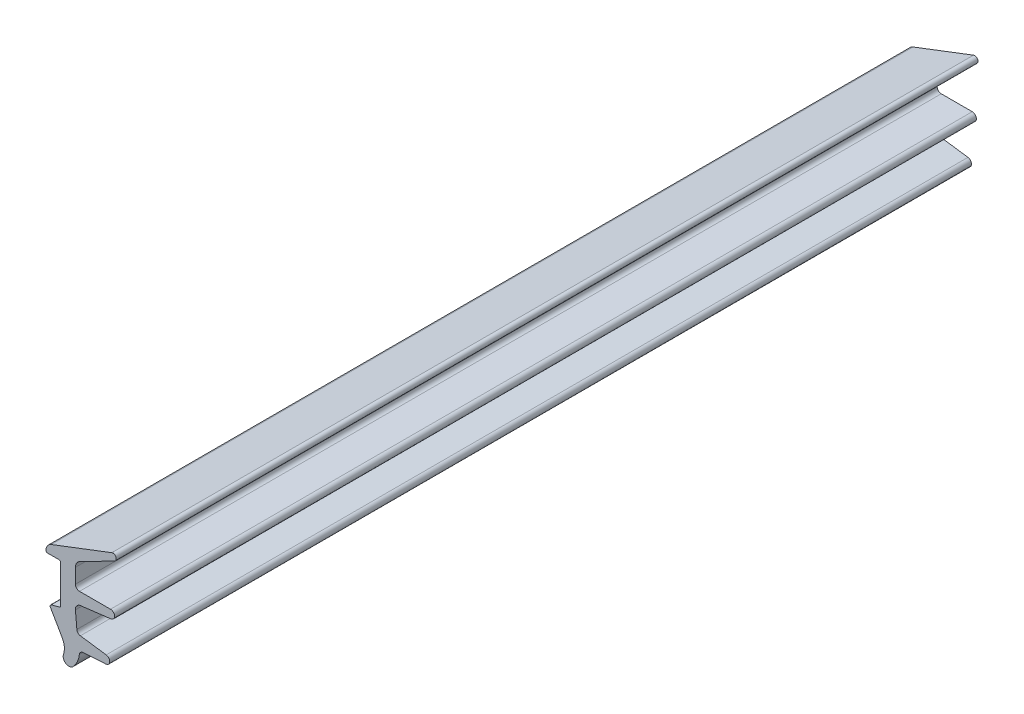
ISO-10303-21;
HEADER;
FILE_DESCRIPTION(('STEP AP214'),'2;1');
FILE_NAME('part.step','',(''),(''),'','','');
FILE_SCHEMA(('AUTOMOTIVE_DESIGN { 1 0 10303 214 1 1 1 1 }'));
ENDSEC;
DATA;
#1=APPLICATION_CONTEXT('core data for automotive mechanical design processes');
#2=APPLICATION_PROTOCOL_DEFINITION('international standard','automotive_design',2000,#1);
#3=PRODUCT_CONTEXT('',#1,'mechanical');
#4=PRODUCT('Part','Part','',(#3));
#5=PRODUCT_RELATED_PRODUCT_CATEGORY('part','',(#4));
#6=PRODUCT_DEFINITION_FORMATION('','',#4);
#7=PRODUCT_DEFINITION_CONTEXT('part definition',#1,'design');
#8=PRODUCT_DEFINITION('design','',#6,#7);
#9=PRODUCT_DEFINITION_SHAPE('','',#8);
#10=(LENGTH_UNIT() NAMED_UNIT(*) SI_UNIT(.MILLI.,.METRE.));
#11=(NAMED_UNIT(*) PLANE_ANGLE_UNIT() SI_UNIT($,.RADIAN.));
#12=(NAMED_UNIT(*) SI_UNIT($,.STERADIAN.) SOLID_ANGLE_UNIT());
#13=UNCERTAINTY_MEASURE_WITH_UNIT(LENGTH_MEASURE(1.E-05),#10,'distance_accuracy_value','');
#14=(GEOMETRIC_REPRESENTATION_CONTEXT(3) GLOBAL_UNCERTAINTY_ASSIGNED_CONTEXT((#13)) GLOBAL_UNIT_ASSIGNED_CONTEXT((#10,
#11,#12)) REPRESENTATION_CONTEXT('',''));
#15=CARTESIAN_POINT('',(0.,0.,0.));
#16=DIRECTION('',(0.,0.,1.));
#17=DIRECTION('',(1.,0.,0.));
#18=AXIS2_PLACEMENT_3D('',#15,#16,#17);
#19=CARTESIAN_POINT('',(-1.15176380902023,-5.26207958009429,0.));
#20=DIRECTION('',(-0.258819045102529,0.965925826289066,0.));
#21=DIRECTION('',(-0.965925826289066,-0.258819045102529,0.));
#22=AXIS2_PLACEMENT_3D('',#19,#20,#21);
#23=PLANE('',#22);
#24=DIRECTION('',(-0.965925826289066,-0.258819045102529,0.));
#25=VECTOR('',#24,1.);
#26=CARTESIAN_POINT('',(-1.15176380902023,-5.26207958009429,-52.75));
#27=LINE('',#26,#25);
#28=CARTESIAN_POINT('',(-0.148236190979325,-4.99318516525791,-52.75));
#29=VERTEX_POINT('',#28);
#30=CARTESIAN_POINT('',(-1.15176380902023,-5.2620795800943,-52.75));
#31=VERTEX_POINT('',#30);
#32=EDGE_CURVE('E214',#29,#31,#27,.T.);
#33=ORIENTED_EDGE('',*,*,#32,.T.);
#34=DIRECTION('',(0.,0.,1.));
#35=VECTOR('',#34,1.);
#36=CARTESIAN_POINT('',(-1.15176380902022,-5.26207958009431,0.));
#37=LINE('',#36,#35);
#38=CARTESIAN_POINT('',(-1.15176380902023,-5.2620795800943,52.75));
#39=VERTEX_POINT('',#38);
#40=EDGE_CURVE('E351',#39,#31,#37,.F.);
#41=ORIENTED_EDGE('',*,*,#40,.F.);
#42=DIRECTION('',(-0.965925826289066,-0.258819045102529,0.));
#43=VECTOR('',#42,1.);
#44=CARTESIAN_POINT('',(-1.15176380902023,-5.26207958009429,52.75));
#45=LINE('',#44,#43);
#46=CARTESIAN_POINT('',(-0.148236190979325,-4.99318516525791,52.75));
#47=VERTEX_POINT('',#46);
#48=EDGE_CURVE('E357',#39,#47,#45,.F.);
#49=ORIENTED_EDGE('',*,*,#48,.T.);
#50=DIRECTION('',(0.,0.,1.));
#51=VECTOR('',#50,1.);
#52=CARTESIAN_POINT('',(-0.148236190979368,-4.99318516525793,0.));
#53=LINE('',#52,#51);
#54=EDGE_CURVE('E359',#47,#29,#53,.F.);
#55=ORIENTED_EDGE('',*,*,#54,.T.);
#56=EDGE_LOOP('',(#33,#41,#49,#55));
#57=FACE_BOUND('',#56,.T.);
#58=ADVANCED_FACE('F15',(#57),#23,.T.);
#59=CARTESIAN_POINT('',(-0.19999999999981,-0.200000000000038,0.));
#60=DIRECTION('',(0.,0.,1.));
#61=DIRECTION('',(1.,0.,0.));
#62=AXIS2_PLACEMENT_3D('',#59,#60,#61);
#63=CYLINDRICAL_SURFACE('',#62,0.199999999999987);
#64=DIRECTION('',(0.,0.,-1.));
#65=VECTOR('',#64,1.);
#66=CARTESIAN_POINT('',(-0.19999999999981,0.,0.));
#67=LINE('',#66,#65);
#68=CARTESIAN_POINT('',(-0.19999999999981,0.,-52.75));
#69=VERTEX_POINT('',#68);
#70=CARTESIAN_POINT('',(-0.19999999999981,0.,52.75));
#71=VERTEX_POINT('',#70);
#72=EDGE_CURVE('E210',#69,#71,#67,.F.);
#73=ORIENTED_EDGE('',*,*,#72,.F.);
#74=CARTESIAN_POINT('',(-0.19999999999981,-0.200000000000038,-52.75));
#75=DIRECTION('',(0.,0.,1.));
#76=DIRECTION('',(1.,0.,0.));
#77=AXIS2_PLACEMENT_3D('',#74,#75,#76);
#78=CIRCLE('',#77,0.199999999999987);
#79=CARTESIAN_POINT('',(1.95047970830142E-13,-0.200000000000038,-52.75));
#80=VERTEX_POINT('',#79);
#81=EDGE_CURVE('E18',#80,#69,#78,.T.);
#82=ORIENTED_EDGE('',*,*,#81,.F.);
#83=DIRECTION('',(0.,0.,1.));
#84=VECTOR('',#83,1.);
#85=CARTESIAN_POINT('',(2.036238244E-13,-0.200000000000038,0.));
#86=LINE('',#85,#84);
#87=CARTESIAN_POINT('',(1.95047970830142E-13,-0.200000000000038,52.75));
#88=VERTEX_POINT('',#87);
#89=EDGE_CURVE('E207',#88,#80,#86,.F.);
#90=ORIENTED_EDGE('',*,*,#89,.F.);
#91=CARTESIAN_POINT('',(-0.19999999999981,-0.200000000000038,52.75));
#92=DIRECTION('',(0.,0.,1.));
#93=DIRECTION('',(1.,0.,0.));
#94=AXIS2_PLACEMENT_3D('',#91,#92,#93);
#95=CIRCLE('',#94,0.199999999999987);
#96=EDGE_CURVE('E213',#71,#88,#95,.F.);
#97=ORIENTED_EDGE('',*,*,#96,.F.);
#98=EDGE_LOOP('',(#73,#82,#90,#97));
#99=FACE_BOUND('',#98,.T.);
#100=ADVANCED_FACE('F205',(#99),#63,.F.);
#101=CARTESIAN_POINT('',(-0.199999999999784,-4.80000000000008,0.));
#102=DIRECTION('',(0.,0.,1.));
#103=DIRECTION('',(1.,0.,0.));
#104=AXIS2_PLACEMENT_3D('',#101,#102,#103);
#105=CYLINDRICAL_SURFACE('',#104,0.200000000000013);
#106=DIRECTION('',(0.,0.,1.));
#107=VECTOR('',#106,1.);
#108=CARTESIAN_POINT('',(2.036238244E-13,-4.80000000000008,0.));
#109=LINE('',#108,#107);
#110=CARTESIAN_POINT('',(1.95047970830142E-13,-4.80000000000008,-52.75));
#111=VERTEX_POINT('',#110);
#112=CARTESIAN_POINT('',(1.95047970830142E-13,-4.80000000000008,52.75));
#113=VERTEX_POINT('',#112);
#114=EDGE_CURVE('E222',#111,#113,#109,.T.);
#115=ORIENTED_EDGE('',*,*,#114,.F.);
#116=CARTESIAN_POINT('',(-0.199999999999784,-4.80000000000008,-52.75));
#117=DIRECTION('',(0.,0.,1.));
#118=DIRECTION('',(1.,0.,0.));
#119=AXIS2_PLACEMENT_3D('',#116,#117,#118);
#120=CIRCLE('',#119,0.200000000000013);
#121=EDGE_CURVE('E226',#29,#111,#120,.T.);
#122=ORIENTED_EDGE('',*,*,#121,.F.);
#123=ORIENTED_EDGE('',*,*,#54,.F.);
#124=CARTESIAN_POINT('',(-0.199999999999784,-4.80000000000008,52.75));
#125=DIRECTION('',(0.,0.,1.));
#126=DIRECTION('',(1.,0.,0.));
#127=AXIS2_PLACEMENT_3D('',#124,#125,#126);
#128=CIRCLE('',#127,0.200000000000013);
#129=EDGE_CURVE('E417',#113,#47,#128,.F.);
#130=ORIENTED_EDGE('',*,*,#129,.F.);
#131=EDGE_LOOP('',(#115,#122,#123,#130));
#132=FACE_BOUND('',#131,.T.);
#133=ADVANCED_FACE('F502',(#132),#105,.F.);
#134=CARTESIAN_POINT('',(-1.09999999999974,-5.45526474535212,0.));
#135=DIRECTION('',(0.,0.,1.));
#136=DIRECTION('',(1.,0.,0.));
#137=AXIS2_PLACEMENT_3D('',#134,#135,#136);
#138=CYLINDRICAL_SURFACE('',#137,0.199999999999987);
#139=CARTESIAN_POINT('',(-1.09999999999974,-5.45526474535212,-52.75));
#140=DIRECTION('',(0.,0.,1.));
#141=DIRECTION('',(1.,0.,0.));
#142=AXIS2_PLACEMENT_3D('',#139,#140,#141);
#143=CIRCLE('',#142,0.199999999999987);
#144=CARTESIAN_POINT('',(-1.27320508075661,-5.55526474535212,-52.75));
#145=VERTEX_POINT('',#144);
#146=EDGE_CURVE('E354',#31,#145,#143,.T.);
#147=ORIENTED_EDGE('',*,*,#146,.T.);
#148=DIRECTION('',(0.,0.,1.));
#149=VECTOR('',#148,1.);
#150=CARTESIAN_POINT('',(-1.27320508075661,-5.55526474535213,0.));
#151=LINE('',#150,#149);
#152=CARTESIAN_POINT('',(-1.27320508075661,-5.55526474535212,52.75));
#153=VERTEX_POINT('',#152);
#154=EDGE_CURVE('E329',#153,#145,#151,.F.);
#155=ORIENTED_EDGE('',*,*,#154,.F.);
#156=CARTESIAN_POINT('',(-1.09999999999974,-5.45526474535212,52.75));
#157=DIRECTION('',(0.,0.,1.));
#158=DIRECTION('',(1.,0.,0.));
#159=AXIS2_PLACEMENT_3D('',#156,#157,#158);
#160=CIRCLE('',#159,0.199999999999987);
#161=EDGE_CURVE('E355',#153,#39,#160,.F.);
#162=ORIENTED_EDGE('',*,*,#161,.T.);
#163=ORIENTED_EDGE('',*,*,#40,.T.);
#164=EDGE_LOOP('',(#147,#155,#162,#163));
#165=FACE_BOUND('',#164,.T.);
#166=ADVANCED_FACE('F497',(#165),#138,.T.);
#167=CARTESIAN_POINT('',(-1.54837324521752,-9.07865950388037,0.));
#168=DIRECTION('',(0.,0.,1.));
#169=DIRECTION('',(1.,0.,0.));
#170=AXIS2_PLACEMENT_3D('',#167,#168,#169);
#171=CYLINDRICAL_SURFACE('',#170,2.);
#172=DIRECTION('',(0.,0.,1.));
#173=VECTOR('',#172,1.);
#174=CARTESIAN_POINT('',(0.183677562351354,-8.07865950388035,0.));
#175=LINE('',#174,#173);
#176=CARTESIAN_POINT('',(0.183677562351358,-8.07865950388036,-52.75));
#177=VERTEX_POINT('',#176);
#178=CARTESIAN_POINT('',(0.183677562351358,-8.07865950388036,52.75));
#179=VERTEX_POINT('',#178);
#180=EDGE_CURVE('E328',#177,#179,#175,.T.);
#181=ORIENTED_EDGE('',*,*,#180,.F.);
#182=CARTESIAN_POINT('',(-1.54837324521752,-9.07865950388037,-52.75));
#183=DIRECTION('',(0.,0.,1.));
#184=DIRECTION('',(1.,0.,0.));
#185=AXIS2_PLACEMENT_3D('',#182,#183,#184);
#186=CIRCLE('',#185,2.);
#187=CARTESIAN_POINT('',(0.383478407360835,-9.59629759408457,-52.75));
#188=VERTEX_POINT('',#187);
#189=EDGE_CURVE('E412',#188,#177,#186,.T.);
#190=ORIENTED_EDGE('',*,*,#189,.F.);
#191=DIRECTION('',(0.,0.,1.));
#192=VECTOR('',#191,1.);
#193=CARTESIAN_POINT('',(0.383478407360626,-9.59629759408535,0.));
#194=LINE('',#193,#192);
#195=CARTESIAN_POINT('',(0.383478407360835,-9.59629759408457,52.75));
#196=VERTEX_POINT('',#195);
#197=EDGE_CURVE('E343',#196,#188,#194,.F.);
#198=ORIENTED_EDGE('',*,*,#197,.F.);
#199=CARTESIAN_POINT('',(-1.54837324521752,-9.07865950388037,52.75));
#200=DIRECTION('',(0.,0.,1.));
#201=DIRECTION('',(1.,0.,0.));
#202=AXIS2_PLACEMENT_3D('',#199,#200,#201);
#203=CIRCLE('',#202,2.);
#204=EDGE_CURVE('E344',#179,#196,#203,.F.);
#205=ORIENTED_EDGE('',*,*,#204,.F.);
#206=EDGE_LOOP('',(#181,#190,#198,#205));
#207=FACE_BOUND('',#206,.T.);
#208=ADVANCED_FACE('F489',(#207),#171,.F.);
#209=CARTESIAN_POINT('',(0.323851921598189,-9.81882666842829,0.));
#210=DIRECTION('',(-0.965925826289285,0.258819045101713,0.));
#211=DIRECTION('',(-0.258819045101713,-0.965925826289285,0.));
#212=AXIS2_PLACEMENT_3D('',#209,#210,#211);
#213=PLANE('',#212);
#214=DIRECTION('',(-0.258819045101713,-0.965925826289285,0.));
#215=VECTOR('',#214,1.);
#216=CARTESIAN_POINT('',(0.323851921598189,-9.81882666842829,-52.75));
#217=LINE('',#216,#215);
#218=CARTESIAN_POINT('',(0.323851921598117,-9.81882666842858,-52.75));
#219=VERTEX_POINT('',#218);
#220=EDGE_CURVE('E345',#188,#219,#217,.T.);
#221=ORIENTED_EDGE('',*,*,#220,.T.);
#222=DIRECTION('',(0.,0.,1.));
#223=VECTOR('',#222,1.);
#224=CARTESIAN_POINT('',(0.323851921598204,-9.8188266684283,0.));
#225=LINE('',#224,#223);
#226=CARTESIAN_POINT('',(0.323851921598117,-9.81882666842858,52.75));
#227=VERTEX_POINT('',#226);
#228=EDGE_CURVE('E323',#227,#219,#225,.F.);
#229=ORIENTED_EDGE('',*,*,#228,.F.);
#230=DIRECTION('',(-0.258819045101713,-0.965925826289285,0.));
#231=VECTOR('',#230,1.);
#232=CARTESIAN_POINT('',(0.323851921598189,-9.81882666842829,52.75));
#233=LINE('',#232,#231);
#234=EDGE_CURVE('E340',#227,#196,#233,.F.);
#235=ORIENTED_EDGE('',*,*,#234,.T.);
#236=ORIENTED_EDGE('',*,*,#197,.T.);
#237=EDGE_LOOP('',(#221,#229,#235,#236));
#238=FACE_BOUND('',#237,.T.);
#239=ADVANCED_FACE('F485',(#238),#213,.T.);
#240=CARTESIAN_POINT('',(2.77918139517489,-8.86828108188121,0.));
#241=DIRECTION('',(0.,0.,1.));
#242=DIRECTION('',(1.,0.,0.));
#243=AXIS2_PLACEMENT_3D('',#240,#241,#242);
#244=CYLINDRICAL_SURFACE('',#243,0.500000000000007);
#245=DIRECTION('',(0.,0.,1.));
#246=VECTOR('',#245,1.);
#247=CARTESIAN_POINT('',(2.28240305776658,-8.81161289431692,0.));
#248=LINE('',#247,#246);
#249=CARTESIAN_POINT('',(2.28240305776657,-8.81161289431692,-52.75));
#250=VERTEX_POINT('',#249);
#251=CARTESIAN_POINT('',(2.28240305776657,-8.81161289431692,52.75));
#252=VERTEX_POINT('',#251);
#253=EDGE_CURVE('E317',#250,#252,#248,.T.);
#254=ORIENTED_EDGE('',*,*,#253,.F.);
#255=CARTESIAN_POINT('',(2.77918139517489,-8.86828108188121,-52.75));
#256=DIRECTION('',(0.,0.,1.));
#257=DIRECTION('',(1.,0.,0.));
#258=AXIS2_PLACEMENT_3D('',#255,#256,#257);
#259=CIRCLE('',#258,0.500000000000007);
#260=CARTESIAN_POINT('',(2.74865712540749,-8.36921368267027,-52.75));
#261=VERTEX_POINT('',#260);
#262=EDGE_CURVE('E347',#261,#250,#259,.T.);
#263=ORIENTED_EDGE('',*,*,#262,.F.);
#264=DIRECTION('',(0.,0.,1.));
#265=VECTOR('',#264,1.);
#266=CARTESIAN_POINT('',(2.7486571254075,-8.36921368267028,0.));
#267=LINE('',#266,#265);
#268=CARTESIAN_POINT('',(2.74865712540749,-8.36921368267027,52.75));
#269=VERTEX_POINT('',#268);
#270=EDGE_CURVE('E314',#269,#261,#267,.F.);
#271=ORIENTED_EDGE('',*,*,#270,.F.);
#272=CARTESIAN_POINT('',(2.77918139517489,-8.86828108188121,52.75));
#273=DIRECTION('',(0.,0.,1.));
#274=DIRECTION('',(1.,0.,0.));
#275=AXIS2_PLACEMENT_3D('',#272,#273,#274);
#276=CIRCLE('',#275,0.500000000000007);
#277=EDGE_CURVE('E408',#252,#269,#276,.F.);
#278=ORIENTED_EDGE('',*,*,#277,.F.);
#279=EDGE_LOOP('',(#254,#263,#271,#278));
#280=FACE_BOUND('',#279,.T.);
#281=ADVANCED_FACE('F475',(#280),#244,.F.);
#282=CARTESIAN_POINT('',(5.5000000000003,-7.69999999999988,0.));
#283=DIRECTION('',(0.,0.,1.));
#284=DIRECTION('',(1.,0.,0.));
#285=AXIS2_PLACEMENT_3D('',#282,#283,#284);
#286=CYLINDRICAL_SURFACE('',#285,0.500000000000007);
#287=CARTESIAN_POINT('',(5.5000000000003,-7.69999999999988,-52.75));
#288=DIRECTION('',(0.,0.,1.));
#289=DIRECTION('',(1.,0.,0.));
#290=AXIS2_PLACEMENT_3D('',#287,#288,#289);
#291=CIRCLE('',#290,0.500000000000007);
#292=CARTESIAN_POINT('',(5.53052426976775,-8.19906739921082,-52.75));
#293=VERTEX_POINT('',#292);
#294=CARTESIAN_POINT('',(5.56958655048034,-7.20486596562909,-52.75));
#295=VERTEX_POINT('',#294);
#296=EDGE_CURVE('E404',#293,#295,#291,.T.);
#297=ORIENTED_EDGE('',*,*,#296,.T.);
#298=DIRECTION('',(0.,0.,1.));
#299=VECTOR('',#298,1.);
#300=CARTESIAN_POINT('',(5.56958655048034,-7.2048659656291,0.));
#301=LINE('',#300,#299);
#302=CARTESIAN_POINT('',(5.56958655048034,-7.20486596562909,52.75));
#303=VERTEX_POINT('',#302);
#304=EDGE_CURVE('E308',#303,#295,#301,.F.);
#305=ORIENTED_EDGE('',*,*,#304,.F.);
#306=CARTESIAN_POINT('',(5.5000000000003,-7.69999999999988,52.75));
#307=DIRECTION('',(0.,0.,1.));
#308=DIRECTION('',(1.,0.,0.));
#309=AXIS2_PLACEMENT_3D('',#306,#307,#308);
#310=CIRCLE('',#309,0.500000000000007);
#311=CARTESIAN_POINT('',(5.53052426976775,-8.19906739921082,52.75));
#312=VERTEX_POINT('',#311);
#313=EDGE_CURVE('E406',#303,#312,#310,.F.);
#314=ORIENTED_EDGE('',*,*,#313,.T.);
#315=DIRECTION('',(0.,0.,1.));
#316=VECTOR('',#315,1.);
#317=CARTESIAN_POINT('',(5.53052426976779,-8.19906739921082,0.));
#318=LINE('',#317,#316);
#319=EDGE_CURVE('E311',#293,#312,#318,.T.);
#320=ORIENTED_EDGE('',*,*,#319,.F.);
#321=EDGE_LOOP('',(#297,#305,#314,#320));
#322=FACE_BOUND('',#321,.T.);
#323=ADVANCED_FACE('F471',(#322),#286,.T.);
#324=CARTESIAN_POINT('',(2.47544367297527,-6.26509875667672,0.));
#325=DIRECTION('',(0.,0.,1.));
#326=DIRECTION('',(1.,0.,0.));
#327=AXIS2_PLACEMENT_3D('',#324,#325,#326);
#328=CYLINDRICAL_SURFACE('',#327,0.500000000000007);
#329=DIRECTION('',(0.,0.,1.));
#330=VECTOR('',#329,1.);
#331=CARTESIAN_POINT('',(2.40585712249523,-6.76023279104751,0.));
#332=LINE('',#331,#330);
#333=CARTESIAN_POINT('',(2.40585712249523,-6.76023279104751,-52.75));
#334=VERTEX_POINT('',#333);
#335=CARTESIAN_POINT('',(2.40585712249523,-6.76023279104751,52.75));
#336=VERTEX_POINT('',#335);
#337=EDGE_CURVE('E305',#334,#336,#332,.T.);
#338=ORIENTED_EDGE('',*,*,#337,.F.);
#339=CARTESIAN_POINT('',(2.47544367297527,-6.26509875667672,-52.75));
#340=DIRECTION('',(0.,0.,1.));
#341=DIRECTION('',(1.,0.,0.));
#342=AXIS2_PLACEMENT_3D('',#339,#340,#341);
#343=CIRCLE('',#342,0.500000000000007);
#344=CARTESIAN_POINT('',(1.9773463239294,-6.30867662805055,-52.75));
#345=VERTEX_POINT('',#344);
#346=EDGE_CURVE('E402',#345,#334,#343,.T.);
#347=ORIENTED_EDGE('',*,*,#346,.F.);
#348=DIRECTION('',(0.,0.,1.));
#349=VECTOR('',#348,1.);
#350=CARTESIAN_POINT('',(1.97734632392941,-6.30867662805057,0.));
#351=LINE('',#350,#349);
#352=CARTESIAN_POINT('',(1.9773463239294,-6.30867662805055,52.75));
#353=VERTEX_POINT('',#352);
#354=EDGE_CURVE('E302',#353,#345,#351,.F.);
#355=ORIENTED_EDGE('',*,*,#354,.F.);
#356=CARTESIAN_POINT('',(2.47544367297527,-6.26509875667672,52.75));
#357=DIRECTION('',(0.,0.,1.));
#358=DIRECTION('',(1.,0.,0.));
#359=AXIS2_PLACEMENT_3D('',#356,#357,#358);
#360=CIRCLE('',#359,0.500000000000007);
#361=EDGE_CURVE('E400',#336,#353,#360,.F.);
#362=ORIENTED_EDGE('',*,*,#361,.F.);
#363=EDGE_LOOP('',(#338,#347,#355,#362));
#364=FACE_BOUND('',#363,.T.);
#365=ADVANCED_FACE('F575',(#364),#328,.F.);
#366=CARTESIAN_POINT('',(2.50000000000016,-4.2510362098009,0.));
#367=DIRECTION('',(0.,0.,1.));
#368=DIRECTION('',(1.,0.,0.));
#369=AXIS2_PLACEMENT_3D('',#366,#367,#368);
#370=CYLINDRICAL_SURFACE('',#369,0.699999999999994);
#371=DIRECTION('',(0.,0.,1.));
#372=VECTOR('',#371,1.);
#373=CARTESIAN_POINT('',(1.80266371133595,-4.31204522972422,0.));
#374=LINE('',#373,#372);
#375=CARTESIAN_POINT('',(1.80266371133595,-4.31204522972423,-52.75));
#376=VERTEX_POINT('',#375);
#377=CARTESIAN_POINT('',(1.80266371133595,-4.31204522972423,52.75));
#378=VERTEX_POINT('',#377);
#379=EDGE_CURVE('E299',#376,#378,#374,.T.);
#380=ORIENTED_EDGE('',*,*,#379,.F.);
#381=CARTESIAN_POINT('',(2.50000000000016,-4.2510362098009,-52.75));
#382=DIRECTION('',(0.,0.,1.));
#383=DIRECTION('',(1.,0.,0.));
#384=AXIS2_PLACEMENT_3D('',#381,#382,#383);
#385=CIRCLE('',#384,0.699999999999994);
#386=CARTESIAN_POINT('',(2.41469145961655,-3.55625390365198,-52.75));
#387=VERTEX_POINT('',#386);
#388=EDGE_CURVE('E398',#387,#376,#385,.T.);
#389=ORIENTED_EDGE('',*,*,#388,.F.);
#390=DIRECTION('',(0.,0.,1.));
#391=VECTOR('',#390,1.);
#392=CARTESIAN_POINT('',(2.41469145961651,-3.55625390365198,0.));
#393=LINE('',#392,#391);
#394=CARTESIAN_POINT('',(2.41469145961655,-3.55625390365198,52.75));
#395=VERTEX_POINT('',#394);
#396=EDGE_CURVE('E296',#395,#387,#393,.F.);
#397=ORIENTED_EDGE('',*,*,#396,.F.);
#398=CARTESIAN_POINT('',(2.50000000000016,-4.2510362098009,52.75));
#399=DIRECTION('',(0.,0.,1.));
#400=DIRECTION('',(1.,0.,0.));
#401=AXIS2_PLACEMENT_3D('',#398,#399,#400);
#402=CIRCLE('',#401,0.699999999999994);
#403=EDGE_CURVE('E396',#378,#395,#402,.F.);
#404=ORIENTED_EDGE('',*,*,#403,.F.);
#405=EDGE_LOOP('',(#380,#389,#397,#404));
#406=FACE_BOUND('',#405,.T.);
#407=ADVANCED_FACE('F571',(#406),#370,.F.);
#408=CARTESIAN_POINT('',(6.10000000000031,-2.59999999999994,0.));
#409=DIRECTION('',(0.,0.,1.));
#410=DIRECTION('',(1.,0.,0.));
#411=AXIS2_PLACEMENT_3D('',#408,#409,#410);
#412=CYLINDRICAL_SURFACE('',#411,0.500000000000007);
#413=CARTESIAN_POINT('',(6.10000000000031,-2.59999999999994,-52.75));
#414=DIRECTION('',(0.,0.,1.));
#415=DIRECTION('',(1.,0.,0.));
#416=AXIS2_PLACEMENT_3D('',#413,#414,#415);
#417=CIRCLE('',#416,0.500000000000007);
#418=CARTESIAN_POINT('',(6.16093467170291,-3.09627307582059,-52.75));
#419=VERTEX_POINT('',#418);
#420=CARTESIAN_POINT('',(6.10000000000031,-2.09999999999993,-52.75));
#421=VERTEX_POINT('',#420);
#422=EDGE_CURVE('E392',#419,#421,#417,.T.);
#423=ORIENTED_EDGE('',*,*,#422,.T.);
#424=DIRECTION('',(0.,0.,1.));
#425=VECTOR('',#424,1.);
#426=CARTESIAN_POINT('',(6.10000000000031,-2.09999999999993,0.));
#427=LINE('',#426,#425);
#428=CARTESIAN_POINT('',(6.10000000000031,-2.09999999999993,52.75));
#429=VERTEX_POINT('',#428);
#430=EDGE_CURVE('E290',#429,#421,#427,.F.);
#431=ORIENTED_EDGE('',*,*,#430,.F.);
#432=CARTESIAN_POINT('',(6.10000000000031,-2.59999999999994,52.75));
#433=DIRECTION('',(0.,0.,1.));
#434=DIRECTION('',(1.,0.,0.));
#435=AXIS2_PLACEMENT_3D('',#432,#433,#434);
#436=CIRCLE('',#435,0.500000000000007);
#437=CARTESIAN_POINT('',(6.16093467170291,-3.09627307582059,52.75));
#438=VERTEX_POINT('',#437);
#439=EDGE_CURVE('E394',#429,#438,#436,.F.);
#440=ORIENTED_EDGE('',*,*,#439,.T.);
#441=DIRECTION('',(0.,0.,1.));
#442=VECTOR('',#441,1.);
#443=CARTESIAN_POINT('',(6.16093467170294,-3.09627307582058,0.));
#444=LINE('',#443,#442);
#445=EDGE_CURVE('E293',#419,#438,#444,.T.);
#446=ORIENTED_EDGE('',*,*,#445,.F.);
#447=EDGE_LOOP('',(#423,#431,#440,#446));
#448=FACE_BOUND('',#447,.T.);
#449=ADVANCED_FACE('F567',(#448),#412,.T.);
#450=CARTESIAN_POINT('',(2.30000000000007,-1.59999999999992,0.));
#451=DIRECTION('',(0.,0.,1.));
#452=DIRECTION('',(1.,0.,0.));
#453=AXIS2_PLACEMENT_3D('',#450,#451,#452);
#454=CYLINDRICAL_SURFACE('',#453,0.500000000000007);
#455=DIRECTION('',(0.,0.,1.));
#456=VECTOR('',#455,1.);
#457=CARTESIAN_POINT('',(2.30000000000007,-2.09999999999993,0.));
#458=LINE('',#457,#456);
#459=CARTESIAN_POINT('',(2.30000000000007,-2.09999999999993,-52.75));
#460=VERTEX_POINT('',#459);
#461=CARTESIAN_POINT('',(2.30000000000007,-2.09999999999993,52.75));
#462=VERTEX_POINT('',#461);
#463=EDGE_CURVE('E287',#460,#462,#458,.T.);
#464=ORIENTED_EDGE('',*,*,#463,.F.);
#465=CARTESIAN_POINT('',(2.30000000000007,-1.59999999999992,-52.75));
#466=DIRECTION('',(0.,0.,1.));
#467=DIRECTION('',(1.,0.,0.));
#468=AXIS2_PLACEMENT_3D('',#465,#466,#467);
#469=CIRCLE('',#468,0.500000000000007);
#470=CARTESIAN_POINT('',(1.80000000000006,-1.59999999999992,-52.75));
#471=VERTEX_POINT('',#470);
#472=EDGE_CURVE('E390',#471,#460,#469,.T.);
#473=ORIENTED_EDGE('',*,*,#472,.F.);
#474=DIRECTION('',(0.,0.,-1.));
#475=VECTOR('',#474,1.);
#476=CARTESIAN_POINT('',(1.80000000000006,-1.59999999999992,0.));
#477=LINE('',#476,#475);
#478=CARTESIAN_POINT('',(1.80000000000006,-1.59999999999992,52.75));
#479=VERTEX_POINT('',#478);
#480=EDGE_CURVE('E284',#479,#471,#477,.T.);
#481=ORIENTED_EDGE('',*,*,#480,.F.);
#482=CARTESIAN_POINT('',(2.30000000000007,-1.59999999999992,52.75));
#483=DIRECTION('',(0.,0.,1.));
#484=DIRECTION('',(1.,0.,0.));
#485=AXIS2_PLACEMENT_3D('',#482,#483,#484);
#486=CIRCLE('',#485,0.500000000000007);
#487=EDGE_CURVE('E388',#462,#479,#486,.F.);
#488=ORIENTED_EDGE('',*,*,#487,.F.);
#489=EDGE_LOOP('',(#464,#473,#481,#488));
#490=FACE_BOUND('',#489,.T.);
#491=ADVANCED_FACE('F563',(#490),#454,.F.);
#492=CARTESIAN_POINT('',(2.80000000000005,0.194451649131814,0.));
#493=DIRECTION('',(0.,0.,1.));
#494=DIRECTION('',(1.,0.,0.));
#495=AXIS2_PLACEMENT_3D('',#492,#493,#494);
#496=CYLINDRICAL_SURFACE('',#495,1.00000000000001);
#497=DIRECTION('',(0.,0.,-1.));
#498=VECTOR('',#497,1.);
#499=CARTESIAN_POINT('',(1.80000000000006,0.194451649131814,0.));
#500=LINE('',#499,#498);
#501=CARTESIAN_POINT('',(1.80000000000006,0.194451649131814,-52.75));
#502=VERTEX_POINT('',#501);
#503=CARTESIAN_POINT('',(1.80000000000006,0.194451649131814,52.75));
#504=VERTEX_POINT('',#503);
#505=EDGE_CURVE('E283',#502,#504,#500,.F.);
#506=ORIENTED_EDGE('',*,*,#505,.F.);
#507=CARTESIAN_POINT('',(2.80000000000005,0.194451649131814,-52.75));
#508=DIRECTION('',(0.,0.,1.));
#509=DIRECTION('',(1.,0.,0.));
#510=AXIS2_PLACEMENT_3D('',#507,#508,#509);
#511=CIRCLE('',#510,1.00000000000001);
#512=CARTESIAN_POINT('',(2.34600950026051,1.08545817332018,-52.75));
#513=VERTEX_POINT('',#512);
#514=EDGE_CURVE('E386',#513,#502,#511,.T.);
#515=ORIENTED_EDGE('',*,*,#514,.F.);
#516=DIRECTION('',(0.,0.,1.));
#517=VECTOR('',#516,1.);
#518=CARTESIAN_POINT('',(2.34600950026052,1.08545817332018,0.));
#519=LINE('',#518,#517);
#520=CARTESIAN_POINT('',(2.34600950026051,1.08545817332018,52.75));
#521=VERTEX_POINT('',#520);
#522=EDGE_CURVE('E279',#521,#513,#519,.F.);
#523=ORIENTED_EDGE('',*,*,#522,.F.);
#524=CARTESIAN_POINT('',(2.80000000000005,0.194451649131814,52.75));
#525=DIRECTION('',(0.,0.,1.));
#526=DIRECTION('',(1.,0.,0.));
#527=AXIS2_PLACEMENT_3D('',#524,#525,#526);
#528=CIRCLE('',#527,1.00000000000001);
#529=EDGE_CURVE('E339',#504,#521,#528,.F.);
#530=ORIENTED_EDGE('',*,*,#529,.F.);
#531=EDGE_LOOP('',(#506,#515,#523,#530));
#532=FACE_BOUND('',#531,.T.);
#533=ADVANCED_FACE('F560',(#532),#496,.F.);
#534=CARTESIAN_POINT('',(-0.19999999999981,0.,0.));
#535=DIRECTION('',(0.,-1.,0.));
#536=DIRECTION('',(0.,0.,-1.));
#537=AXIS2_PLACEMENT_3D('',#534,#535,#536);
#538=PLANE('',#537);
#539=DIRECTION('',(1.,0.,0.));
#540=VECTOR('',#539,1.);
#541=CARTESIAN_POINT('',(-0.19999999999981,0.,-52.75));
#542=LINE('',#541,#540);
#543=CARTESIAN_POINT('',(-1.59999999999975,0.,-52.75));
#544=VERTEX_POINT('',#543);
#545=EDGE_CURVE('E335',#544,#69,#542,.T.);
#546=ORIENTED_EDGE('',*,*,#545,.T.);
#547=ORIENTED_EDGE('',*,*,#72,.T.);
#548=DIRECTION('',(1.,0.,0.));
#549=VECTOR('',#548,1.);
#550=CARTESIAN_POINT('',(-0.19999999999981,0.,52.75));
#551=LINE('',#550,#549);
#552=CARTESIAN_POINT('',(-1.59999999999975,0.,52.75));
#553=VERTEX_POINT('',#552);
#554=EDGE_CURVE('E337',#71,#553,#551,.F.);
#555=ORIENTED_EDGE('',*,*,#554,.T.);
#556=DIRECTION('',(0.,0.,1.));
#557=VECTOR('',#556,1.);
#558=CARTESIAN_POINT('',(-1.59999999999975,0.,0.));
#559=LINE('',#558,#557);
#560=EDGE_CURVE('E277',#544,#553,#559,.T.);
#561=ORIENTED_EDGE('',*,*,#560,.F.);
#562=EDGE_LOOP('',(#546,#547,#555,#561));
#563=FACE_BOUND('',#562,.T.);
#564=ADVANCED_FACE('F423',(#563),#538,.T.);
#565=CARTESIAN_POINT('',(2.036238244E-13,-4.80000000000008,0.));
#566=DIRECTION('',(-1.,0.,0.));
#567=DIRECTION('',(0.,0.,1.));
#568=AXIS2_PLACEMENT_3D('',#565,#566,#567);
#569=PLANE('',#568);
#570=DIRECTION('',(0.,1.,0.));
#571=VECTOR('',#570,1.);
#572=CARTESIAN_POINT('',(1.86482773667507E-13,-2.93552070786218,-52.75));
#573=LINE('',#572,#571);
#574=EDGE_CURVE('E219',#80,#111,#573,.F.);
#575=ORIENTED_EDGE('',*,*,#574,.T.);
#576=ORIENTED_EDGE('',*,*,#114,.T.);
#577=DIRECTION('',(0.,1.,0.));
#578=VECTOR('',#577,1.);
#579=CARTESIAN_POINT('',(1.86482773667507E-13,-2.93552070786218,52.75));
#580=LINE('',#579,#578);
#581=EDGE_CURVE('E221',#88,#113,#580,.F.);
#582=ORIENTED_EDGE('',*,*,#581,.F.);
#583=ORIENTED_EDGE('',*,*,#89,.T.);
#584=EDGE_LOOP('',(#575,#576,#582,#583));
#585=FACE_BOUND('',#584,.T.);
#586=ADVANCED_FACE('F217',(#585),#569,.T.);
#587=CARTESIAN_POINT('',(0.183677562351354,-8.07865950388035,0.));
#588=DIRECTION('',(-0.866025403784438,-0.500000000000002,0.));
#589=DIRECTION('',(0.500000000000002,-0.866025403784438,0.));
#590=AXIS2_PLACEMENT_3D('',#587,#588,#589);
#591=PLANE('',#590);
#592=DIRECTION('',(0.499999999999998,-0.86602540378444,0.));
#593=VECTOR('',#592,1.);
#594=CARTESIAN_POINT('',(-1.2732050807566,-5.55526474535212,-52.75));
#595=LINE('',#594,#593);
#596=EDGE_CURVE('E228',#145,#177,#595,.T.);
#597=ORIENTED_EDGE('',*,*,#596,.T.);
#598=ORIENTED_EDGE('',*,*,#180,.T.);
#599=DIRECTION('',(0.499999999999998,-0.86602540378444,0.));
#600=VECTOR('',#599,1.);
#601=CARTESIAN_POINT('',(-1.2732050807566,-5.55526474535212,52.75));
#602=LINE('',#601,#600);
#603=EDGE_CURVE('E269',#153,#179,#602,.T.);
#604=ORIENTED_EDGE('',*,*,#603,.F.);
#605=ORIENTED_EDGE('',*,*,#154,.T.);
#606=EDGE_LOOP('',(#597,#598,#604,#605));
#607=FACE_BOUND('',#606,.T.);
#608=ADVANCED_FACE('F493',(#607),#591,.T.);
#609=CARTESIAN_POINT('',(1.00000000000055,-10.0000000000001,0.));
#610=DIRECTION('',(0.,0.,1.));
#611=DIRECTION('',(1.,0.,0.));
#612=AXIS2_PLACEMENT_3D('',#609,#610,#611);
#613=CYLINDRICAL_SURFACE('',#612,0.699999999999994);
#614=CARTESIAN_POINT('',(1.00000000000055,-10.0000000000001,-52.75));
#615=DIRECTION('',(0.,0.,1.));
#616=DIRECTION('',(1.,0.,0.));
#617=AXIS2_PLACEMENT_3D('',#614,#615,#616);
#618=CIRCLE('',#617,0.699999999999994);
#619=CARTESIAN_POINT('',(1.52511090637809,-10.4628806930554,-52.75));
#620=VERTEX_POINT('',#619);
#621=EDGE_CURVE('E232',#219,#620,#618,.T.);
#622=ORIENTED_EDGE('',*,*,#621,.T.);
#623=DIRECTION('',(0.,0.,1.));
#624=VECTOR('',#623,1.);
#625=CARTESIAN_POINT('',(1.52511090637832,-10.4628806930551,0.));
#626=LINE('',#625,#624);
#627=CARTESIAN_POINT('',(1.5251109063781,-10.4628806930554,52.75));
#628=VERTEX_POINT('',#627);
#629=EDGE_CURVE('E320',#628,#620,#626,.F.);
#630=ORIENTED_EDGE('',*,*,#629,.F.);
#631=CARTESIAN_POINT('',(1.00000000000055,-10.0000000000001,52.75));
#632=DIRECTION('',(0.,0.,1.));
#633=DIRECTION('',(1.,0.,0.));
#634=AXIS2_PLACEMENT_3D('',#631,#632,#633);
#635=CIRCLE('',#634,0.699999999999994);
#636=EDGE_CURVE('E272',#227,#628,#635,.T.);
#637=ORIENTED_EDGE('',*,*,#636,.F.);
#638=ORIENTED_EDGE('',*,*,#228,.T.);
#639=EDGE_LOOP('',(#622,#630,#637,#638));
#640=FACE_BOUND('',#639,.T.);
#641=ADVANCED_FACE('F481',(#640),#613,.T.);
#642=CARTESIAN_POINT('',(-0.617934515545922,-8.48076740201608,0.));
#643=DIRECTION('',(0.,0.,1.));
#644=DIRECTION('',(1.,0.,0.));
#645=AXIS2_PLACEMENT_3D('',#642,#643,#644);
#646=CYLINDRICAL_SURFACE('',#645,2.91914658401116);
#647=CARTESIAN_POINT('',(-0.617934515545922,-8.48076740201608,-52.75));
#648=DIRECTION('',(0.,0.,1.));
#649=DIRECTION('',(1.,0.,0.));
#650=AXIS2_PLACEMENT_3D('',#647,#648,#649);
#651=CIRCLE('',#650,2.91914658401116);
#652=EDGE_CURVE('E372',#620,#250,#651,.T.);
#653=ORIENTED_EDGE('',*,*,#652,.T.);
#654=ORIENTED_EDGE('',*,*,#253,.T.);
#655=CARTESIAN_POINT('',(-0.617934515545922,-8.48076740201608,52.75));
#656=DIRECTION('',(0.,0.,1.));
#657=DIRECTION('',(1.,0.,0.));
#658=AXIS2_PLACEMENT_3D('',#655,#656,#657);
#659=CIRCLE('',#658,2.91914658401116);
#660=EDGE_CURVE('E268',#628,#252,#659,.T.);
#661=ORIENTED_EDGE('',*,*,#660,.F.);
#662=ORIENTED_EDGE('',*,*,#629,.T.);
#663=EDGE_LOOP('',(#653,#654,#661,#662));
#664=FACE_BOUND('',#663,.T.);
#665=ADVANCED_FACE('F477',(#664),#646,.T.);
#666=CARTESIAN_POINT('',(5.53052426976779,-8.19906739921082,0.));
#667=DIRECTION('',(0.061048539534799,-0.99813479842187,0.));
#668=DIRECTION('',(0.99813479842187,0.061048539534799,0.));
#669=AXIS2_PLACEMENT_3D('',#666,#667,#668);
#670=PLANE('',#669);
#671=DIRECTION('',(0.99813479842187,0.061048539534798,0.));
#672=VECTOR('',#671,1.);
#673=CARTESIAN_POINT('',(2.7486571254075,-8.36921368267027,-52.75));
#674=LINE('',#673,#672);
#675=EDGE_CURVE('E375',#261,#293,#674,.T.);
#676=ORIENTED_EDGE('',*,*,#675,.T.);
#677=ORIENTED_EDGE('',*,*,#319,.T.);
#678=DIRECTION('',(0.99813479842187,0.061048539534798,0.));
#679=VECTOR('',#678,1.);
#680=CARTESIAN_POINT('',(2.7486571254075,-8.36921368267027,52.75));
#681=LINE('',#680,#679);
#682=EDGE_CURVE('E265',#269,#312,#681,.T.);
#683=ORIENTED_EDGE('',*,*,#682,.F.);
#684=ORIENTED_EDGE('',*,*,#270,.T.);
#685=EDGE_LOOP('',(#676,#677,#683,#684));
#686=FACE_BOUND('',#685,.T.);
#687=ADVANCED_FACE('F462',(#686),#670,.T.);
#688=CARTESIAN_POINT('',(2.40585712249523,-6.76023279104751,0.));
#689=DIRECTION('',(0.139173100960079,0.990268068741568,0.));
#690=DIRECTION('',(-0.990268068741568,0.139173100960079,0.));
#691=AXIS2_PLACEMENT_3D('',#688,#689,#690);
#692=PLANE('',#691);
#693=DIRECTION('',(-0.990268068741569,0.139173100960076,0.));
#694=VECTOR('',#693,1.);
#695=CARTESIAN_POINT('',(5.56958655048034,-7.20486596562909,-52.75));
#696=LINE('',#695,#694);
#697=EDGE_CURVE('E457',#295,#334,#696,.T.);
#698=ORIENTED_EDGE('',*,*,#697,.T.);
#699=ORIENTED_EDGE('',*,*,#337,.T.);
#700=DIRECTION('',(-0.990268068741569,0.139173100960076,0.));
#701=VECTOR('',#700,1.);
#702=CARTESIAN_POINT('',(5.56958655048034,-7.20486596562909,52.75));
#703=LINE('',#702,#701);
#704=EDGE_CURVE('E262',#303,#336,#703,.T.);
#705=ORIENTED_EDGE('',*,*,#704,.F.);
#706=ORIENTED_EDGE('',*,*,#304,.T.);
#707=EDGE_LOOP('',(#698,#699,#705,#706));
#708=FACE_BOUND('',#707,.T.);
#709=ADVANCED_FACE('F543',(#708),#692,.T.);
#710=CARTESIAN_POINT('',(1.80266371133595,-4.31204522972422,0.));
#711=DIRECTION('',(0.996194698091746,0.08715574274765,0.));
#712=DIRECTION('',(-0.08715574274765,0.996194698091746,0.));
#713=AXIS2_PLACEMENT_3D('',#710,#711,#712);
#714=PLANE('',#713);
#715=DIRECTION('',(-0.0871557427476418,0.996194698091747,0.));
#716=VECTOR('',#715,1.);
#717=CARTESIAN_POINT('',(1.97734632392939,-6.30867662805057,-52.75));
#718=LINE('',#717,#716);
#719=EDGE_CURVE('E454',#345,#376,#718,.T.);
#720=ORIENTED_EDGE('',*,*,#719,.T.);
#721=ORIENTED_EDGE('',*,*,#379,.T.);
#722=DIRECTION('',(-0.0871557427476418,0.996194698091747,0.));
#723=VECTOR('',#722,1.);
#724=CARTESIAN_POINT('',(1.97734632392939,-6.30867662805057,52.75));
#725=LINE('',#724,#723);
#726=EDGE_CURVE('E259',#353,#378,#725,.T.);
#727=ORIENTED_EDGE('',*,*,#726,.F.);
#728=ORIENTED_EDGE('',*,*,#354,.T.);
#729=EDGE_LOOP('',(#720,#721,#727,#728));
#730=FACE_BOUND('',#729,.T.);
#731=ADVANCED_FACE('F539',(#730),#714,.T.);
#732=CARTESIAN_POINT('',(6.16093467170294,-3.09627307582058,0.));
#733=DIRECTION('',(0.121869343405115,-0.992546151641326,0.));
#734=DIRECTION('',(0.992546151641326,0.121869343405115,0.));
#735=AXIS2_PLACEMENT_3D('',#732,#733,#734);
#736=PLANE('',#735);
#737=DIRECTION('',(0.992546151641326,0.121869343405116,0.));
#738=VECTOR('',#737,1.);
#739=CARTESIAN_POINT('',(2.41469145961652,-3.55625390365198,-52.75));
#740=LINE('',#739,#738);
#741=EDGE_CURVE('E451',#387,#419,#740,.T.);
#742=ORIENTED_EDGE('',*,*,#741,.T.);
#743=ORIENTED_EDGE('',*,*,#445,.T.);
#744=DIRECTION('',(0.992546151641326,0.121869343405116,0.));
#745=VECTOR('',#744,1.);
#746=CARTESIAN_POINT('',(2.41469145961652,-3.55625390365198,52.75));
#747=LINE('',#746,#745);
#748=EDGE_CURVE('E256',#395,#438,#747,.T.);
#749=ORIENTED_EDGE('',*,*,#748,.F.);
#750=ORIENTED_EDGE('',*,*,#396,.T.);
#751=EDGE_LOOP('',(#742,#743,#749,#750));
#752=FACE_BOUND('',#751,.T.);
#753=ADVANCED_FACE('F535',(#752),#736,.T.);
#754=CARTESIAN_POINT('',(2.30000000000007,-2.09999999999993,0.));
#755=DIRECTION('',(0.,1.,0.));
#756=DIRECTION('',(0.,0.,1.));
#757=AXIS2_PLACEMENT_3D('',#754,#755,#756);
#758=PLANE('',#757);
#759=DIRECTION('',(1.,0.,0.));
#760=VECTOR('',#759,1.);
#761=CARTESIAN_POINT('',(2.46983416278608,-2.09999999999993,-52.75));
#762=LINE('',#761,#760);
#763=EDGE_CURVE('E446',#421,#460,#762,.F.);
#764=ORIENTED_EDGE('',*,*,#763,.T.);
#765=ORIENTED_EDGE('',*,*,#463,.T.);
#766=DIRECTION('',(1.,0.,0.));
#767=VECTOR('',#766,1.);
#768=CARTESIAN_POINT('',(2.46983416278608,-2.09999999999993,52.75));
#769=LINE('',#768,#767);
#770=EDGE_CURVE('E253',#429,#462,#769,.F.);
#771=ORIENTED_EDGE('',*,*,#770,.F.);
#772=ORIENTED_EDGE('',*,*,#430,.T.);
#773=EDGE_LOOP('',(#764,#765,#771,#772));
#774=FACE_BOUND('',#773,.T.);
#775=ADVANCED_FACE('F531',(#774),#758,.T.);
#776=CARTESIAN_POINT('',(1.80000000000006,0.194451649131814,0.));
#777=DIRECTION('',(1.,0.,0.));
#778=DIRECTION('',(0.,0.,-1.));
#779=AXIS2_PLACEMENT_3D('',#776,#777,#778);
#780=PLANE('',#779);
#781=DIRECTION('',(0.,1.,0.));
#782=VECTOR('',#781,1.);
#783=CARTESIAN_POINT('',(1.80000000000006,-2.93552070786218,-52.75));
#784=LINE('',#783,#782);
#785=EDGE_CURVE('E443',#471,#502,#784,.T.);
#786=ORIENTED_EDGE('',*,*,#785,.T.);
#787=ORIENTED_EDGE('',*,*,#505,.T.);
#788=DIRECTION('',(0.,1.,0.));
#789=VECTOR('',#788,1.);
#790=CARTESIAN_POINT('',(1.80000000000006,-2.93552070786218,52.75));
#791=LINE('',#790,#789);
#792=EDGE_CURVE('E250',#479,#504,#791,.T.);
#793=ORIENTED_EDGE('',*,*,#792,.F.);
#794=ORIENTED_EDGE('',*,*,#480,.T.);
#795=EDGE_LOOP('',(#786,#787,#793,#794));
#796=FACE_BOUND('',#795,.T.);
#797=ADVANCED_FACE('F528',(#796),#780,.T.);
#798=CARTESIAN_POINT('',(6.58159619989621,3.24359739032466,0.));
#799=DIRECTION('',(0.453990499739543,-0.89100652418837,0.));
#800=DIRECTION('',(0.89100652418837,0.453990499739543,0.));
#801=AXIS2_PLACEMENT_3D('',#798,#799,#800);
#802=PLANE('',#801);
#803=DIRECTION('',(0.89100652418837,0.453990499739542,0.));
#804=VECTOR('',#803,1.);
#805=CARTESIAN_POINT('',(2.34600950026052,1.08545817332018,-52.75));
#806=LINE('',#805,#804);
#807=CARTESIAN_POINT('',(6.58159619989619,3.24359739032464,-52.75));
#808=VERTEX_POINT('',#807);
#809=EDGE_CURVE('E371',#513,#808,#806,.T.);
#810=ORIENTED_EDGE('',*,*,#809,.T.);
#811=DIRECTION('',(0.,0.,1.));
#812=VECTOR('',#811,1.);
#813=CARTESIAN_POINT('',(6.58159619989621,3.24359739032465,0.));
#814=LINE('',#813,#812);
#815=CARTESIAN_POINT('',(6.58159619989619,3.24359739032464,52.75));
#816=VERTEX_POINT('',#815);
#817=EDGE_CURVE('E229',#816,#808,#814,.F.);
#818=ORIENTED_EDGE('',*,*,#817,.F.);
#819=DIRECTION('',(0.89100652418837,0.453990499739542,0.));
#820=VECTOR('',#819,1.);
#821=CARTESIAN_POINT('',(2.34600950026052,1.08545817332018,52.75));
#822=LINE('',#821,#820);
#823=EDGE_CURVE('E248',#521,#816,#822,.T.);
#824=ORIENTED_EDGE('',*,*,#823,.F.);
#825=ORIENTED_EDGE('',*,*,#522,.T.);
#826=EDGE_LOOP('',(#810,#818,#824,#825));
#827=FACE_BOUND('',#826,.T.);
#828=ADVANCED_FACE('F441',(#827),#802,.T.);
#829=CARTESIAN_POINT('',(-1.59999999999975,0.199999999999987,0.));
#830=DIRECTION('',(0.,0.,1.));
#831=DIRECTION('',(1.,0.,0.));
#832=AXIS2_PLACEMENT_3D('',#829,#830,#831);
#833=CYLINDRICAL_SURFACE('',#832,0.199999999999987);
#834=CARTESIAN_POINT('',(-1.59999999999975,0.199999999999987,-52.75));
#835=DIRECTION('',(0.,0.,1.));
#836=DIRECTION('',(1.,0.,0.));
#837=AXIS2_PLACEMENT_3D('',#834,#835,#836);
#838=CIRCLE('',#837,0.199999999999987);
#839=CARTESIAN_POINT('',(-1.79999999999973,0.199999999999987,-52.75));
#840=VERTEX_POINT('',#839);
#841=EDGE_CURVE('E366',#840,#544,#838,.T.);
#842=ORIENTED_EDGE('',*,*,#841,.T.);
#843=ORIENTED_EDGE('',*,*,#560,.T.);
#844=CARTESIAN_POINT('',(-1.59999999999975,0.199999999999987,52.75));
#845=DIRECTION('',(0.,0.,1.));
#846=DIRECTION('',(1.,0.,0.));
#847=AXIS2_PLACEMENT_3D('',#844,#845,#846);
#848=CIRCLE('',#847,0.199999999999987);
#849=CARTESIAN_POINT('',(-1.79999999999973,0.199999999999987,52.75));
#850=VERTEX_POINT('',#849);
#851=EDGE_CURVE('E274',#850,#553,#848,.T.);
#852=ORIENTED_EDGE('',*,*,#851,.F.);
#853=DIRECTION('',(0.,0.,1.));
#854=VECTOR('',#853,1.);
#855=CARTESIAN_POINT('',(-1.79999999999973,0.199999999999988,0.));
#856=LINE('',#855,#854);
#857=EDGE_CURVE('E247',#840,#850,#856,.T.);
#858=ORIENTED_EDGE('',*,*,#857,.F.);
#859=EDGE_LOOP('',(#842,#843,#852,#858));
#860=FACE_BOUND('',#859,.T.);
#861=ADVANCED_FACE('F427',(#860),#833,.T.);
#862=CARTESIAN_POINT('',(2.46983416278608,-2.93552070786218,52.75));
#863=DIRECTION('',(0.,0.,1.));
#864=DIRECTION('',(1.,0.,0.));
#865=AXIS2_PLACEMENT_3D('',#862,#863,#864);
#866=PLANE('',#865);
#867=CARTESIAN_POINT('',(6.40000000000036,3.59999999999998,52.75));
#868=DIRECTION('',(0.,0.,1.));
#869=DIRECTION('',(1.,0.,0.));
#870=AXIS2_PLACEMENT_3D('',#867,#868,#869);
#871=CIRCLE('',#870,0.4);
#872=CARTESIAN_POINT('',(6.2569386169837,3.97354175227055,52.75));
#873=VERTEX_POINT('',#872);
#874=EDGE_CURVE('E235',#873,#816,#871,.F.);
#875=ORIENTED_EDGE('',*,*,#874,.F.);
#876=DIRECTION('',(-0.933854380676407,-0.357653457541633,0.));
#877=VECTOR('',#876,1.);
#878=CARTESIAN_POINT('',(-1.15765345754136,1.13385438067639,52.75));
#879=LINE('',#878,#877);
#880=CARTESIAN_POINT('',(-1.15765345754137,1.13385438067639,52.75));
#881=VERTEX_POINT('',#880);
#882=EDGE_CURVE('E242',#881,#873,#879,.F.);
#883=ORIENTED_EDGE('',*,*,#882,.F.);
#884=CARTESIAN_POINT('',(-0.799999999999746,0.199999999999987,52.75));
#885=DIRECTION('',(0.,0.,1.));
#886=DIRECTION('',(1.,0.,0.));
#887=AXIS2_PLACEMENT_3D('',#884,#885,#886);
#888=CIRCLE('',#887,0.999999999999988);
#889=EDGE_CURVE('E363',#850,#881,#888,.F.);
#890=ORIENTED_EDGE('',*,*,#889,.F.);
#891=ORIENTED_EDGE('',*,*,#851,.T.);
#892=ORIENTED_EDGE('',*,*,#554,.F.);
#893=ORIENTED_EDGE('',*,*,#96,.T.);
#894=ORIENTED_EDGE('',*,*,#581,.T.);
#895=ORIENTED_EDGE('',*,*,#129,.T.);
#896=ORIENTED_EDGE('',*,*,#48,.F.);
#897=ORIENTED_EDGE('',*,*,#161,.F.);
#898=ORIENTED_EDGE('',*,*,#603,.T.);
#899=ORIENTED_EDGE('',*,*,#204,.T.);
#900=ORIENTED_EDGE('',*,*,#234,.F.);
#901=ORIENTED_EDGE('',*,*,#636,.T.);
#902=ORIENTED_EDGE('',*,*,#660,.T.);
#903=ORIENTED_EDGE('',*,*,#277,.T.);
#904=ORIENTED_EDGE('',*,*,#682,.T.);
#905=ORIENTED_EDGE('',*,*,#313,.F.);
#906=ORIENTED_EDGE('',*,*,#704,.T.);
#907=ORIENTED_EDGE('',*,*,#361,.T.);
#908=ORIENTED_EDGE('',*,*,#726,.T.);
#909=ORIENTED_EDGE('',*,*,#403,.T.);
#910=ORIENTED_EDGE('',*,*,#748,.T.);
#911=ORIENTED_EDGE('',*,*,#439,.F.);
#912=ORIENTED_EDGE('',*,*,#770,.T.);
#913=ORIENTED_EDGE('',*,*,#487,.T.);
#914=ORIENTED_EDGE('',*,*,#792,.T.);
#915=ORIENTED_EDGE('',*,*,#529,.T.);
#916=ORIENTED_EDGE('',*,*,#823,.T.);
#917=EDGE_LOOP('',(#875,#883,#890,#891,#892,#893,#894,#895,#896,#897,#898,#899,#900,#901,#902,
#903,#904,#905,#906,#907,#908,#909,#910,#911,#912,#913,#914,#915,#916));
#918=FACE_BOUND('',#917,.T.);
#919=ADVANCED_FACE('F421',(#918),#866,.T.);
#920=CARTESIAN_POINT('',(6.40000000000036,3.59999999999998,0.));
#921=DIRECTION('',(0.,0.,1.));
#922=DIRECTION('',(1.,0.,0.));
#923=AXIS2_PLACEMENT_3D('',#920,#921,#922);
#924=CYLINDRICAL_SURFACE('',#923,0.4);
#925=CARTESIAN_POINT('',(6.40000000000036,3.59999999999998,-52.75));
#926=DIRECTION('',(0.,0.,1.));
#927=DIRECTION('',(1.,0.,0.));
#928=AXIS2_PLACEMENT_3D('',#925,#926,#927);
#929=CIRCLE('',#928,0.4);
#930=CARTESIAN_POINT('',(6.2569386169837,3.97354175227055,-52.75));
#931=VERTEX_POINT('',#930);
#932=EDGE_CURVE('E369',#808,#931,#929,.T.);
#933=ORIENTED_EDGE('',*,*,#932,.T.);
#934=DIRECTION('',(0.,0.,1.));
#935=VECTOR('',#934,1.);
#936=CARTESIAN_POINT('',(6.2569386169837,3.97354175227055,0.));
#937=LINE('',#936,#935);
#938=EDGE_CURVE('E239',#873,#931,#937,.F.);
#939=ORIENTED_EDGE('',*,*,#938,.F.);
#940=ORIENTED_EDGE('',*,*,#874,.T.);
#941=ORIENTED_EDGE('',*,*,#817,.T.);
#942=EDGE_LOOP('',(#933,#939,#940,#941));
#943=FACE_BOUND('',#942,.T.);
#944=ADVANCED_FACE('F437',(#943),#924,.T.);
#945=CARTESIAN_POINT('',(2.46983416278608,-2.93552070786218,-52.75));
#946=DIRECTION('',(0.,0.,1.));
#947=DIRECTION('',(1.,0.,0.));
#948=AXIS2_PLACEMENT_3D('',#945,#946,#947);
#949=PLANE('',#948);
#950=ORIENTED_EDGE('',*,*,#841,.F.);
#951=CARTESIAN_POINT('',(-0.799999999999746,0.199999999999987,-52.75));
#952=DIRECTION('',(0.,0.,1.));
#953=DIRECTION('',(1.,0.,0.));
#954=AXIS2_PLACEMENT_3D('',#951,#952,#953);
#955=CIRCLE('',#954,0.999999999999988);
#956=CARTESIAN_POINT('',(-1.15765345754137,1.13385438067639,-52.75));
#957=VERTEX_POINT('',#956);
#958=EDGE_CURVE('E33',#957,#840,#955,.T.);
#959=ORIENTED_EDGE('',*,*,#958,.F.);
#960=DIRECTION('',(-0.933854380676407,-0.357653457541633,0.));
#961=VECTOR('',#960,1.);
#962=CARTESIAN_POINT('',(-1.15765345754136,1.13385438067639,-52.75));
#963=LINE('',#962,#961);
#964=EDGE_CURVE('E24',#931,#957,#963,.T.);
#965=ORIENTED_EDGE('',*,*,#964,.F.);
#966=ORIENTED_EDGE('',*,*,#932,.F.);
#967=ORIENTED_EDGE('',*,*,#809,.F.);
#968=ORIENTED_EDGE('',*,*,#514,.T.);
#969=ORIENTED_EDGE('',*,*,#785,.F.);
#970=ORIENTED_EDGE('',*,*,#472,.T.);
#971=ORIENTED_EDGE('',*,*,#763,.F.);
#972=ORIENTED_EDGE('',*,*,#422,.F.);
#973=ORIENTED_EDGE('',*,*,#741,.F.);
#974=ORIENTED_EDGE('',*,*,#388,.T.);
#975=ORIENTED_EDGE('',*,*,#719,.F.);
#976=ORIENTED_EDGE('',*,*,#346,.T.);
#977=ORIENTED_EDGE('',*,*,#697,.F.);
#978=ORIENTED_EDGE('',*,*,#296,.F.);
#979=ORIENTED_EDGE('',*,*,#675,.F.);
#980=ORIENTED_EDGE('',*,*,#262,.T.);
#981=ORIENTED_EDGE('',*,*,#652,.F.);
#982=ORIENTED_EDGE('',*,*,#621,.F.);
#983=ORIENTED_EDGE('',*,*,#220,.F.);
#984=ORIENTED_EDGE('',*,*,#189,.T.);
#985=ORIENTED_EDGE('',*,*,#596,.F.);
#986=ORIENTED_EDGE('',*,*,#146,.F.);
#987=ORIENTED_EDGE('',*,*,#32,.F.);
#988=ORIENTED_EDGE('',*,*,#121,.T.);
#989=ORIENTED_EDGE('',*,*,#574,.F.);
#990=ORIENTED_EDGE('',*,*,#81,.T.);
#991=ORIENTED_EDGE('',*,*,#545,.F.);
#992=EDGE_LOOP('',(#950,#959,#965,#966,#967,#968,#969,#970,#971,#972,#973,#974,#975,#976,#977,
#978,#979,#980,#981,#982,#983,#984,#985,#986,#987,#988,#989,#990,#991));
#993=FACE_BOUND('',#992,.T.);
#994=ADVANCED_FACE('F224',(#993),#949,.F.);
#995=CARTESIAN_POINT('',(-0.799999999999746,0.199999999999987,0.));
#996=DIRECTION('',(0.,0.,1.));
#997=DIRECTION('',(1.,0.,0.));
#998=AXIS2_PLACEMENT_3D('',#995,#996,#997);
#999=CYLINDRICAL_SURFACE('',#998,0.999999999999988);
#1000=ORIENTED_EDGE('',*,*,#958,.T.);
#1001=ORIENTED_EDGE('',*,*,#857,.T.);
#1002=ORIENTED_EDGE('',*,*,#889,.T.);
#1003=DIRECTION('',(0.,0.,1.));
#1004=VECTOR('',#1003,1.);
#1005=CARTESIAN_POINT('',(-1.15765345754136,1.13385438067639,0.));
#1006=LINE('',#1005,#1004);
#1007=EDGE_CURVE('E10',#957,#881,#1006,.T.);
#1008=ORIENTED_EDGE('',*,*,#1007,.F.);
#1009=EDGE_LOOP('',(#1000,#1001,#1002,#1008));
#1010=FACE_BOUND('',#1009,.T.);
#1011=ADVANCED_FACE('F430',(#1010),#999,.T.);
#1012=CARTESIAN_POINT('',(-1.15765345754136,1.13385438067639,0.));
#1013=DIRECTION('',(-0.357653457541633,0.933854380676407,0.));
#1014=DIRECTION('',(-0.933854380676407,-0.357653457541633,0.));
#1015=AXIS2_PLACEMENT_3D('',#1012,#1013,#1014);
#1016=PLANE('',#1015);
#1017=ORIENTED_EDGE('',*,*,#964,.T.);
#1018=ORIENTED_EDGE('',*,*,#1007,.T.);
#1019=ORIENTED_EDGE('',*,*,#882,.T.);
#1020=ORIENTED_EDGE('',*,*,#938,.T.);
#1021=EDGE_LOOP('',(#1017,#1018,#1019,#1020));
#1022=FACE_BOUND('',#1021,.T.);
#1023=ADVANCED_FACE('F432',(#1022),#1016,.T.);
#1024=CLOSED_SHELL('',(#58,#100,#133,#166,#208,#239,#281,#323,#365,#407,#449,#491,#533,#564,
#586,#608,#641,#665,#687,#709,#731,#753,#775,#797,#828,#861,#919,#944,#994,#1011,#1023));
#1025=MANIFOLD_SOLID_BREP('B1',#1024);
#1026=ADVANCED_BREP_SHAPE_REPRESENTATION('',(#18,#1025),#14);
#1027=SHAPE_DEFINITION_REPRESENTATION(#9,#1026);
ENDSEC;
END-ISO-10303-21;
